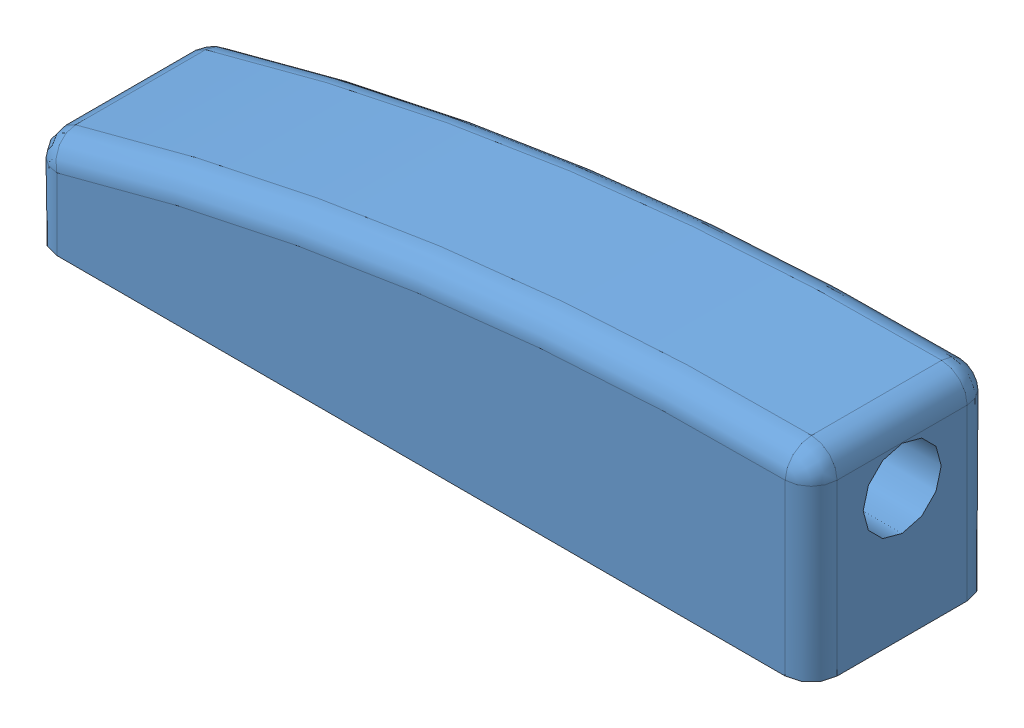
SolidWorks assembly Chassis Segway.sldasm, configuration Défaut (file format 10000). Lengths in mm.
Overall size (420 257.88 720).
3 component instances, 3 part files, 5 mates.
Components (placement in the parent):
- Chassis-1: Chassis.SLDPRT [Défaut] at origin size (420 257.88 720)
- Piece1-1: Piece1.SLDPRT [Défaut] at (32.5104 -45.0328 -150) x (0 0 1) z (-1 0 0) size (300 60 100)
- Support guidon-1: Support guidon.SLDPRT [Défaut] at (5.9589 49.9672 0) size (300 75.33 70)
Mates (geometry in assembly coordinates):
- Coïncidente1: coincident anti-aligned: plane of Chassis-1 through (-44.4896 -45.0328 220) normal (0 1 0); plane of Piece1-1 through (132.5104 -45.0328 -150) normal (0 -1 0)
- Distance1: distance = 65 mm anti-aligned: plane of Chassis-1 through (-94.4896 49.9672 -215) normal (0 0 1); plane of Piece1-1 through (32.5104 14.9672 -150) normal (0 0 -1)
- Coïncidente2: coincident aligned: plane of Chassis-1; plane of Support guidon-1
- Coïncidente3: coincident anti-aligned: plane of Chassis-1 through (-94.4896 49.9672 220) normal (0 1 0); plane of Support guidon-1 through (-62.3087 49.9672 35) normal (0 -1 0)
- Distance2: distance = 168 mm anti-aligned: plane of Chassis-1 through (300.5104 49.9672 220) normal (-1 0 0); plane of Piece1-1 through (132.5104 14.9672 -150) normal (1 0 0)
